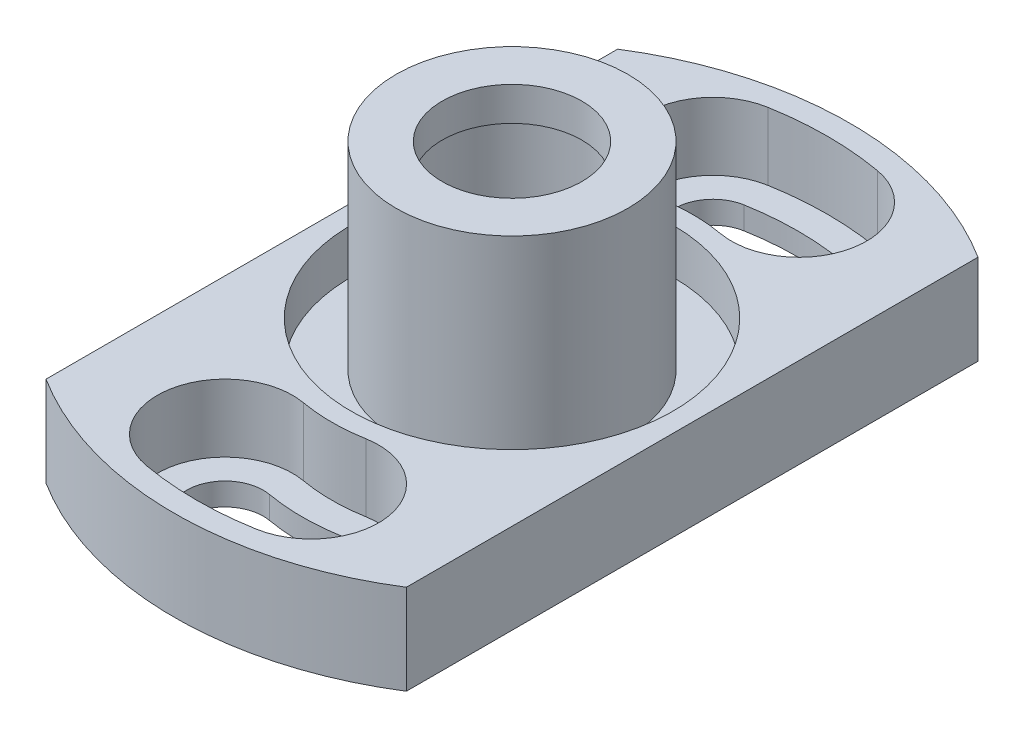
ISO-10303-21;
HEADER;
FILE_DESCRIPTION(('STEP AP214'),'2;1');
FILE_NAME('part.step','',(''),(''),'','','');
FILE_SCHEMA(('AUTOMOTIVE_DESIGN { 1 0 10303 214 1 1 1 1 }'));
ENDSEC;
DATA;
#1=APPLICATION_CONTEXT('core data for automotive mechanical design processes');
#2=APPLICATION_PROTOCOL_DEFINITION('international standard','automotive_design',2000,#1);
#3=PRODUCT_CONTEXT('',#1,'mechanical');
#4=PRODUCT('Part','Part','',(#3));
#5=PRODUCT_RELATED_PRODUCT_CATEGORY('part','',(#4));
#6=PRODUCT_DEFINITION_FORMATION('','',#4);
#7=PRODUCT_DEFINITION_CONTEXT('part definition',#1,'design');
#8=PRODUCT_DEFINITION('design','',#6,#7);
#9=PRODUCT_DEFINITION_SHAPE('','',#8);
#10=(LENGTH_UNIT() NAMED_UNIT(*) SI_UNIT(.MILLI.,.METRE.));
#11=(NAMED_UNIT(*) PLANE_ANGLE_UNIT() SI_UNIT($,.RADIAN.));
#12=(NAMED_UNIT(*) SI_UNIT($,.STERADIAN.) SOLID_ANGLE_UNIT());
#13=UNCERTAINTY_MEASURE_WITH_UNIT(LENGTH_MEASURE(1.E-05),#10,'distance_accuracy_value','');
#14=(GEOMETRIC_REPRESENTATION_CONTEXT(3) GLOBAL_UNCERTAINTY_ASSIGNED_CONTEXT((#13)) GLOBAL_UNIT_ASSIGNED_CONTEXT((#10,
#11,#12)) REPRESENTATION_CONTEXT('',''));
#15=CARTESIAN_POINT('',(0.,0.,0.));
#16=DIRECTION('',(0.,0.,1.));
#17=DIRECTION('',(1.,0.,0.));
#18=AXIS2_PLACEMENT_3D('',#15,#16,#17);
#19=CARTESIAN_POINT('',(15.,4.,0.));
#20=DIRECTION('',(0.,1.,0.));
#21=DIRECTION('',(0.,0.,1.));
#22=AXIS2_PLACEMENT_3D('',#19,#20,#21);
#23=PLANE('',#22);
#24=CARTESIAN_POINT('',(-1.91012995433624,4.,-10.8328852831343));
#25=DIRECTION('',(0.,1.,0.));
#26=DIRECTION('',(0.,0.,-1.));
#27=AXIS2_PLACEMENT_3D('',#24,#25,#26);
#28=CIRCLE('',#27,3.);
#29=CARTESIAN_POINT('',(-2.43107448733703,4.,-13.7873085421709));
#30=VERTEX_POINT('',#29);
#31=CARTESIAN_POINT('',(-1.38918542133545,4.,-7.87846202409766));
#32=VERTEX_POINT('',#31);
#33=EDGE_CURVE('E39',#30,#32,#28,.T.);
#34=ORIENTED_EDGE('',*,*,#33,.F.);
#35=CARTESIAN_POINT('',(0.,4.,0.));
#36=DIRECTION('',(0.,1.,0.));
#37=DIRECTION('',(0.,0.,-1.));
#38=AXIS2_PLACEMENT_3D('',#35,#36,#37);
#39=CIRCLE('',#38,14.);
#40=CARTESIAN_POINT('',(2.43107448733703,4.,-13.7873085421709));
#41=VERTEX_POINT('',#40);
#42=EDGE_CURVE('E202',#41,#30,#39,.T.);
#43=ORIENTED_EDGE('',*,*,#42,.F.);
#44=CARTESIAN_POINT('',(1.91012995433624,4.,-10.8328852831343));
#45=DIRECTION('',(0.,1.,0.));
#46=DIRECTION('',(0.,0.,-1.));
#47=AXIS2_PLACEMENT_3D('',#44,#45,#46);
#48=CIRCLE('',#47,3.);
#49=CARTESIAN_POINT('',(1.38918542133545,4.,-7.87846202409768));
#50=VERTEX_POINT('',#49);
#51=EDGE_CURVE('E205',#50,#41,#48,.T.);
#52=ORIENTED_EDGE('',*,*,#51,.F.);
#53=CARTESIAN_POINT('',(0.,4.,0.));
#54=DIRECTION('',(0.,-1.,0.));
#55=DIRECTION('',(0.,0.,-1.));
#56=AXIS2_PLACEMENT_3D('',#53,#54,#55);
#57=CIRCLE('',#56,8.);
#58=EDGE_CURVE('E209',#32,#50,#57,.T.);
#59=ORIENTED_EDGE('',*,*,#58,.F.);
#60=EDGE_LOOP('',(#34,#43,#52,#59));
#61=FACE_BOUND('',#60,.T.);
#62=CARTESIAN_POINT('',(0.,4.,0.));
#63=DIRECTION('',(0.,-1.,0.));
#64=DIRECTION('',(0.,0.,-1.));
#65=AXIS2_PLACEMENT_3D('',#62,#63,#64);
#66=CIRCLE('',#65,7.15);
#67=CARTESIAN_POINT('',(0.,4.,-7.15));
#68=VERTEX_POINT('',#67);
#69=EDGE_CURVE('E310',#68,#68,#66,.T.);
#70=ORIENTED_EDGE('',*,*,#69,.T.);
#71=EDGE_LOOP('',(#70));
#72=FACE_BOUND('',#71,.T.);
#73=CARTESIAN_POINT('',(0.,4.,0.));
#74=DIRECTION('',(0.,-1.,0.));
#75=DIRECTION('',(0.,0.,-1.));
#76=AXIS2_PLACEMENT_3D('',#73,#74,#75);
#77=CIRCLE('',#76,15.);
#78=CARTESIAN_POINT('',(8.,4.,12.6885775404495));
#79=VERTEX_POINT('',#78);
#80=CARTESIAN_POINT('',(-8.,4.,12.6885775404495));
#81=VERTEX_POINT('',#80);
#82=EDGE_CURVE('E316',#79,#81,#77,.T.);
#83=ORIENTED_EDGE('',*,*,#82,.F.);
#84=DIRECTION('',(0.,0.,-1.));
#85=VECTOR('',#84,1.);
#86=CARTESIAN_POINT('',(8.,4.,0.));
#87=LINE('',#86,#85);
#88=CARTESIAN_POINT('',(8.,4.,-12.6885775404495));
#89=VERTEX_POINT('',#88);
#90=EDGE_CURVE('E336',#79,#89,#87,.T.);
#91=ORIENTED_EDGE('',*,*,#90,.T.);
#92=CARTESIAN_POINT('',(-8.,4.,-12.6885775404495));
#93=VERTEX_POINT('',#92);
#94=EDGE_CURVE('E313',#93,#89,#77,.T.);
#95=ORIENTED_EDGE('',*,*,#94,.F.);
#96=DIRECTION('',(0.,0.,1.));
#97=VECTOR('',#96,1.);
#98=CARTESIAN_POINT('',(-8.,4.,0.));
#99=LINE('',#98,#97);
#100=EDGE_CURVE('E333',#93,#81,#99,.T.);
#101=ORIENTED_EDGE('',*,*,#100,.T.);
#102=EDGE_LOOP('',(#83,#91,#95,#101));
#103=FACE_BOUND('',#102,.T.);
#104=CARTESIAN_POINT('',(-1.91012995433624,4.,10.8328852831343));
#105=DIRECTION('',(0.,1.,0.));
#106=DIRECTION('',(0.,0.,1.));
#107=AXIS2_PLACEMENT_3D('',#104,#105,#106);
#108=CIRCLE('',#107,3.);
#109=CARTESIAN_POINT('',(-1.38918542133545,4.,7.87846202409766));
#110=VERTEX_POINT('',#109);
#111=CARTESIAN_POINT('',(-2.43107448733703,4.,13.7873085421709));
#112=VERTEX_POINT('',#111);
#113=EDGE_CURVE('E31',#110,#112,#108,.T.);
#114=ORIENTED_EDGE('',*,*,#113,.F.);
#115=CARTESIAN_POINT('',(0.,4.,0.));
#116=DIRECTION('',(0.,-1.,0.));
#117=DIRECTION('',(0.,0.,1.));
#118=AXIS2_PLACEMENT_3D('',#115,#116,#117);
#119=CIRCLE('',#118,8.);
#120=CARTESIAN_POINT('',(1.38918542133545,4.,7.87846202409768));
#121=VERTEX_POINT('',#120);
#122=EDGE_CURVE('E174',#121,#110,#119,.T.);
#123=ORIENTED_EDGE('',*,*,#122,.F.);
#124=CARTESIAN_POINT('',(1.91012995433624,4.,10.8328852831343));
#125=DIRECTION('',(0.,1.,0.));
#126=DIRECTION('',(0.,0.,1.));
#127=AXIS2_PLACEMENT_3D('',#124,#125,#126);
#128=CIRCLE('',#127,3.);
#129=CARTESIAN_POINT('',(2.43107448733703,4.,13.7873085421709));
#130=VERTEX_POINT('',#129);
#131=EDGE_CURVE('E177',#130,#121,#128,.T.);
#132=ORIENTED_EDGE('',*,*,#131,.F.);
#133=CARTESIAN_POINT('',(0.,4.,0.));
#134=DIRECTION('',(0.,1.,0.));
#135=DIRECTION('',(0.,0.,1.));
#136=AXIS2_PLACEMENT_3D('',#133,#134,#135);
#137=CIRCLE('',#136,14.);
#138=EDGE_CURVE('E183',#112,#130,#137,.T.);
#139=ORIENTED_EDGE('',*,*,#138,.F.);
#140=EDGE_LOOP('',(#114,#123,#132,#139));
#141=FACE_BOUND('',#140,.T.);
#142=ADVANCED_FACE('F16',(#61,#72,#103,#141),#23,.T.);
#143=CARTESIAN_POINT('',(-1.91012995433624,0.,10.8328852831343));
#144=DIRECTION('',(0.,1.,0.));
#145=DIRECTION('',(0.,0.,1.));
#146=AXIS2_PLACEMENT_3D('',#143,#144,#145);
#147=CYLINDRICAL_SURFACE('',#146,1.7);
#148=CARTESIAN_POINT('',(-1.91012995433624,1.,10.8328852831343));
#149=DIRECTION('',(0.,1.,0.));
#150=DIRECTION('',(0.,0.,1.));
#151=AXIS2_PLACEMENT_3D('',#148,#149,#150);
#152=CIRCLE('',#151,1.7);
#153=CARTESIAN_POINT('',(-2.20533185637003,1.,12.507058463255));
#154=VERTEX_POINT('',#153);
#155=CARTESIAN_POINT('',(-1.61492805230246,1.,9.15871210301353));
#156=VERTEX_POINT('',#155);
#157=EDGE_CURVE('E226',#154,#156,#152,.F.);
#158=ORIENTED_EDGE('',*,*,#157,.F.);
#159=DIRECTION('',(0.,1.,0.));
#160=VECTOR('',#159,1.);
#161=CARTESIAN_POINT('',(-2.20533185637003,0.,12.507058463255));
#162=LINE('',#161,#160);
#163=CARTESIAN_POINT('',(-2.20533185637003,0.,12.507058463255));
#164=VERTEX_POINT('',#163);
#165=EDGE_CURVE('E251',#164,#154,#162,.T.);
#166=ORIENTED_EDGE('',*,*,#165,.F.);
#167=CARTESIAN_POINT('',(-1.91012995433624,0.,10.8328852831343));
#168=DIRECTION('',(0.,1.,0.));
#169=DIRECTION('',(0.,0.,1.));
#170=AXIS2_PLACEMENT_3D('',#167,#168,#169);
#171=CIRCLE('',#170,1.7);
#172=CARTESIAN_POINT('',(-1.61492805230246,0.,9.15871210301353));
#173=VERTEX_POINT('',#172);
#174=EDGE_CURVE('E238',#173,#164,#171,.T.);
#175=ORIENTED_EDGE('',*,*,#174,.F.);
#176=DIRECTION('',(0.,1.,0.));
#177=VECTOR('',#176,1.);
#178=CARTESIAN_POINT('',(-1.61492805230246,0.,9.15871210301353));
#179=LINE('',#178,#177);
#180=EDGE_CURVE('E252',#173,#156,#179,.T.);
#181=ORIENTED_EDGE('',*,*,#180,.T.);
#182=EDGE_LOOP('',(#158,#166,#175,#181));
#183=FACE_BOUND('',#182,.T.);
#184=ADVANCED_FACE('F345',(#183),#147,.F.);
#185=CARTESIAN_POINT('',(0.,0.,0.));
#186=DIRECTION('',(0.,1.,0.));
#187=DIRECTION('',(0.,0.,1.));
#188=AXIS2_PLACEMENT_3D('',#185,#186,#187);
#189=CYLINDRICAL_SURFACE('',#188,9.3);
#190=CARTESIAN_POINT('',(0.,1.,0.));
#191=DIRECTION('',(0.,1.,0.));
#192=DIRECTION('',(0.,0.,1.));
#193=AXIS2_PLACEMENT_3D('',#190,#191,#192);
#194=CIRCLE('',#193,9.3);
#195=CARTESIAN_POINT('',(1.61492805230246,1.,9.15871210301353));
#196=VERTEX_POINT('',#195);
#197=EDGE_CURVE('E224',#156,#196,#194,.T.);
#198=ORIENTED_EDGE('',*,*,#197,.F.);
#199=ORIENTED_EDGE('',*,*,#180,.F.);
#200=CARTESIAN_POINT('',(0.,0.,0.));
#201=DIRECTION('',(0.,-1.,0.));
#202=DIRECTION('',(0.,0.,1.));
#203=AXIS2_PLACEMENT_3D('',#200,#201,#202);
#204=CIRCLE('',#203,9.3);
#205=CARTESIAN_POINT('',(1.61492805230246,0.,9.15871210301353));
#206=VERTEX_POINT('',#205);
#207=EDGE_CURVE('E248',#206,#173,#204,.T.);
#208=ORIENTED_EDGE('',*,*,#207,.F.);
#209=DIRECTION('',(0.,1.,0.));
#210=VECTOR('',#209,1.);
#211=CARTESIAN_POINT('',(1.61492805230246,0.,9.15871210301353));
#212=LINE('',#211,#210);
#213=EDGE_CURVE('E256',#206,#196,#212,.T.);
#214=ORIENTED_EDGE('',*,*,#213,.T.);
#215=EDGE_LOOP('',(#198,#199,#208,#214));
#216=FACE_BOUND('',#215,.T.);
#217=ADVANCED_FACE('F353',(#216),#189,.T.);
#218=CARTESIAN_POINT('',(1.91012995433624,0.,10.8328852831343));
#219=DIRECTION('',(0.,1.,0.));
#220=DIRECTION('',(0.,0.,1.));
#221=AXIS2_PLACEMENT_3D('',#218,#219,#220);
#222=CYLINDRICAL_SURFACE('',#221,1.7);
#223=CARTESIAN_POINT('',(1.91012995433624,1.,10.8328852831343));
#224=DIRECTION('',(0.,1.,0.));
#225=DIRECTION('',(0.,0.,1.));
#226=AXIS2_PLACEMENT_3D('',#223,#224,#225);
#227=CIRCLE('',#226,1.7);
#228=CARTESIAN_POINT('',(2.20533185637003,1.,12.507058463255));
#229=VERTEX_POINT('',#228);
#230=EDGE_CURVE('E189',#196,#229,#227,.F.);
#231=ORIENTED_EDGE('',*,*,#230,.F.);
#232=ORIENTED_EDGE('',*,*,#213,.F.);
#233=CARTESIAN_POINT('',(1.91012995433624,0.,10.8328852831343));
#234=DIRECTION('',(0.,1.,0.));
#235=DIRECTION('',(0.,0.,1.));
#236=AXIS2_PLACEMENT_3D('',#233,#234,#235);
#237=CIRCLE('',#236,1.7);
#238=CARTESIAN_POINT('',(2.20533185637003,0.,12.507058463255));
#239=VERTEX_POINT('',#238);
#240=EDGE_CURVE('E245',#239,#206,#237,.T.);
#241=ORIENTED_EDGE('',*,*,#240,.F.);
#242=DIRECTION('',(0.,1.,0.));
#243=VECTOR('',#242,1.);
#244=CARTESIAN_POINT('',(2.20533185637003,0.,12.507058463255));
#245=LINE('',#244,#243);
#246=EDGE_CURVE('E259',#239,#229,#245,.T.);
#247=ORIENTED_EDGE('',*,*,#246,.T.);
#248=EDGE_LOOP('',(#231,#232,#241,#247));
#249=FACE_BOUND('',#248,.T.);
#250=ADVANCED_FACE('F355',(#249),#222,.F.);
#251=CARTESIAN_POINT('',(0.,0.,0.));
#252=DIRECTION('',(0.,1.,0.));
#253=DIRECTION('',(0.,0.,1.));
#254=AXIS2_PLACEMENT_3D('',#251,#252,#253);
#255=CYLINDRICAL_SURFACE('',#254,12.7);
#256=CARTESIAN_POINT('',(0.,1.,0.));
#257=DIRECTION('',(0.,1.,0.));
#258=DIRECTION('',(0.,0.,1.));
#259=AXIS2_PLACEMENT_3D('',#256,#257,#258);
#260=CIRCLE('',#259,12.7);
#261=EDGE_CURVE('E24',#229,#154,#260,.F.);
#262=ORIENTED_EDGE('',*,*,#261,.F.);
#263=ORIENTED_EDGE('',*,*,#246,.F.);
#264=CARTESIAN_POINT('',(0.,0.,0.));
#265=DIRECTION('',(0.,1.,0.));
#266=DIRECTION('',(0.,0.,1.));
#267=AXIS2_PLACEMENT_3D('',#264,#265,#266);
#268=CIRCLE('',#267,12.7);
#269=EDGE_CURVE('E241',#164,#239,#268,.T.);
#270=ORIENTED_EDGE('',*,*,#269,.F.);
#271=ORIENTED_EDGE('',*,*,#165,.T.);
#272=EDGE_LOOP('',(#262,#263,#270,#271));
#273=FACE_BOUND('',#272,.T.);
#274=ADVANCED_FACE('F348',(#273),#255,.F.);
#275=CARTESIAN_POINT('',(3.6,0.,0.));
#276=DIRECTION('',(0.,-1.,0.));
#277=DIRECTION('',(0.,0.,-1.));
#278=AXIS2_PLACEMENT_3D('',#275,#276,#277);
#279=PLANE('',#278);
#280=CARTESIAN_POINT('',(-1.91012995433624,0.,-10.8328852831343));
#281=DIRECTION('',(0.,1.,0.));
#282=DIRECTION('',(0.,0.,-1.));
#283=AXIS2_PLACEMENT_3D('',#280,#281,#282);
#284=CIRCLE('',#283,1.7);
#285=CARTESIAN_POINT('',(-2.20533185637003,0.,-12.507058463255));
#286=VERTEX_POINT('',#285);
#287=CARTESIAN_POINT('',(-1.61492805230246,0.,-9.15871210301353));
#288=VERTEX_POINT('',#287);
#289=EDGE_CURVE('E242',#286,#288,#284,.T.);
#290=ORIENTED_EDGE('',*,*,#289,.T.);
#291=CARTESIAN_POINT('',(0.,0.,0.));
#292=DIRECTION('',(0.,-1.,0.));
#293=DIRECTION('',(0.,0.,-1.));
#294=AXIS2_PLACEMENT_3D('',#291,#292,#293);
#295=CIRCLE('',#294,9.3);
#296=CARTESIAN_POINT('',(1.61492805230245,0.,-9.15871210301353));
#297=VERTEX_POINT('',#296);
#298=EDGE_CURVE('E281',#288,#297,#295,.T.);
#299=ORIENTED_EDGE('',*,*,#298,.T.);
#300=CARTESIAN_POINT('',(1.91012995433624,0.,-10.8328852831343));
#301=DIRECTION('',(0.,1.,0.));
#302=DIRECTION('',(0.,0.,-1.));
#303=AXIS2_PLACEMENT_3D('',#300,#301,#302);
#304=CIRCLE('',#303,1.7);
#305=CARTESIAN_POINT('',(2.20533185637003,0.,-12.507058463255));
#306=VERTEX_POINT('',#305);
#307=EDGE_CURVE('E278',#297,#306,#304,.T.);
#308=ORIENTED_EDGE('',*,*,#307,.T.);
#309=CARTESIAN_POINT('',(0.,0.,0.));
#310=DIRECTION('',(0.,1.,0.));
#311=DIRECTION('',(0.,0.,-1.));
#312=AXIS2_PLACEMENT_3D('',#309,#310,#311);
#313=CIRCLE('',#312,12.7);
#314=EDGE_CURVE('E267',#306,#286,#313,.T.);
#315=ORIENTED_EDGE('',*,*,#314,.T.);
#316=EDGE_LOOP('',(#290,#299,#308,#315));
#317=FACE_BOUND('',#316,.T.);
#318=CARTESIAN_POINT('',(0.,0.,0.));
#319=DIRECTION('',(0.,-1.,0.));
#320=DIRECTION('',(0.,0.,-1.));
#321=AXIS2_PLACEMENT_3D('',#318,#319,#320);
#322=CIRCLE('',#321,3.6);
#323=CARTESIAN_POINT('',(0.,0.,-3.6));
#324=VERTEX_POINT('',#323);
#325=EDGE_CURVE('E321',#324,#324,#322,.T.);
#326=ORIENTED_EDGE('',*,*,#325,.F.);
#327=EDGE_LOOP('',(#326));
#328=FACE_BOUND('',#327,.T.);
#329=CARTESIAN_POINT('',(0.,0.,0.));
#330=DIRECTION('',(0.,-1.,0.));
#331=DIRECTION('',(0.,0.,-1.));
#332=AXIS2_PLACEMENT_3D('',#329,#330,#331);
#333=CIRCLE('',#332,15.);
#334=CARTESIAN_POINT('',(-8.,0.,-12.6885775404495));
#335=VERTEX_POINT('',#334);
#336=CARTESIAN_POINT('',(8.,0.,-12.6885775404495));
#337=VERTEX_POINT('',#336);
#338=EDGE_CURVE('E317',#335,#337,#333,.T.);
#339=ORIENTED_EDGE('',*,*,#338,.T.);
#340=DIRECTION('',(0.,0.,-1.));
#341=VECTOR('',#340,1.);
#342=CARTESIAN_POINT('',(8.,0.,-17.8859181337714));
#343=LINE('',#342,#341);
#344=CARTESIAN_POINT('',(8.,0.,12.6885775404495));
#345=VERTEX_POINT('',#344);
#346=EDGE_CURVE('E255',#345,#337,#343,.T.);
#347=ORIENTED_EDGE('',*,*,#346,.F.);
#348=CARTESIAN_POINT('',(-8.,0.,12.6885775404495));
#349=VERTEX_POINT('',#348);
#350=EDGE_CURVE('E320',#345,#349,#333,.T.);
#351=ORIENTED_EDGE('',*,*,#350,.T.);
#352=DIRECTION('',(0.,0.,1.));
#353=VECTOR('',#352,1.);
#354=CARTESIAN_POINT('',(-8.,0.,-17.8859181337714));
#355=LINE('',#354,#353);
#356=EDGE_CURVE('E287',#335,#349,#355,.T.);
#357=ORIENTED_EDGE('',*,*,#356,.F.);
#358=EDGE_LOOP('',(#339,#347,#351,#357));
#359=FACE_BOUND('',#358,.T.);
#360=ORIENTED_EDGE('',*,*,#174,.T.);
#361=ORIENTED_EDGE('',*,*,#269,.T.);
#362=ORIENTED_EDGE('',*,*,#240,.T.);
#363=ORIENTED_EDGE('',*,*,#207,.T.);
#364=EDGE_LOOP('',(#360,#361,#362,#363));
#365=FACE_BOUND('',#364,.T.);
#366=ADVANCED_FACE('F350',(#317,#328,#359,#365),#279,.T.);
#367=CARTESIAN_POINT('',(0.,0.,0.));
#368=DIRECTION('',(0.,-1.,0.));
#369=DIRECTION('',(0.,0.,-1.));
#370=AXIS2_PLACEMENT_3D('',#367,#368,#369);
#371=CYLINDRICAL_SURFACE('',#370,15.);
#372=ORIENTED_EDGE('',*,*,#350,.F.);
#373=DIRECTION('',(0.,-1.,0.));
#374=VECTOR('',#373,1.);
#375=CARTESIAN_POINT('',(8.,0.,12.6885775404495));
#376=LINE('',#375,#374);
#377=EDGE_CURVE('E298',#345,#79,#376,.F.);
#378=ORIENTED_EDGE('',*,*,#377,.T.);
#379=ORIENTED_EDGE('',*,*,#82,.T.);
#380=DIRECTION('',(0.,-1.,0.));
#381=VECTOR('',#380,1.);
#382=CARTESIAN_POINT('',(-8.,0.,12.6885775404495));
#383=LINE('',#382,#381);
#384=EDGE_CURVE('E289',#81,#349,#383,.T.);
#385=ORIENTED_EDGE('',*,*,#384,.T.);
#386=EDGE_LOOP('',(#372,#378,#379,#385));
#387=FACE_BOUND('',#386,.T.);
#388=ADVANCED_FACE('F379',(#387),#371,.T.);
#389=ORIENTED_EDGE('',*,*,#94,.T.);
#390=DIRECTION('',(0.,-1.,0.));
#391=VECTOR('',#390,1.);
#392=CARTESIAN_POINT('',(8.,0.,-12.6885775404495));
#393=LINE('',#392,#391);
#394=EDGE_CURVE('E295',#89,#337,#393,.T.);
#395=ORIENTED_EDGE('',*,*,#394,.T.);
#396=ORIENTED_EDGE('',*,*,#338,.F.);
#397=DIRECTION('',(0.,-1.,0.));
#398=VECTOR('',#397,1.);
#399=CARTESIAN_POINT('',(-8.,0.,-12.6885775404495));
#400=LINE('',#399,#398);
#401=EDGE_CURVE('E292',#335,#93,#400,.F.);
#402=ORIENTED_EDGE('',*,*,#401,.T.);
#403=EDGE_LOOP('',(#389,#395,#396,#402));
#404=FACE_BOUND('',#403,.T.);
#405=ADVANCED_FACE('F382',(#404),#371,.T.);
#406=CARTESIAN_POINT('',(5.15,10.8,0.));
#407=DIRECTION('',(0.,1.,0.));
#408=DIRECTION('',(0.,0.,1.));
#409=AXIS2_PLACEMENT_3D('',#406,#407,#408);
#410=PLANE('',#409);
#411=CARTESIAN_POINT('',(0.,10.8,0.));
#412=DIRECTION('',(0.,-1.,0.));
#413=DIRECTION('',(0.,0.,-1.));
#414=AXIS2_PLACEMENT_3D('',#411,#412,#413);
#415=CIRCLE('',#414,3.1);
#416=CARTESIAN_POINT('',(0.,10.8,-3.1));
#417=VERTEX_POINT('',#416);
#418=EDGE_CURVE('E330',#417,#417,#415,.T.);
#419=ORIENTED_EDGE('',*,*,#418,.T.);
#420=EDGE_LOOP('',(#419));
#421=FACE_BOUND('',#420,.T.);
#422=CARTESIAN_POINT('',(0.,10.8,0.));
#423=DIRECTION('',(0.,-1.,0.));
#424=DIRECTION('',(0.,0.,-1.));
#425=AXIS2_PLACEMENT_3D('',#422,#423,#424);
#426=CIRCLE('',#425,5.15);
#427=CARTESIAN_POINT('',(0.,10.8,-5.15));
#428=VERTEX_POINT('',#427);
#429=EDGE_CURVE('E301',#428,#428,#426,.T.);
#430=ORIENTED_EDGE('',*,*,#429,.F.);
#431=EDGE_LOOP('',(#430));
#432=FACE_BOUND('',#431,.T.);
#433=ADVANCED_FACE('F18',(#421,#432),#410,.T.);
#434=CARTESIAN_POINT('',(0.,0.,0.));
#435=DIRECTION('',(0.,-1.,0.));
#436=DIRECTION('',(0.,0.,-1.));
#437=AXIS2_PLACEMENT_3D('',#434,#435,#436);
#438=CYLINDRICAL_SURFACE('',#437,3.1);
#439=CARTESIAN_POINT('',(0.,9.3,0.));
#440=DIRECTION('',(0.,-1.,0.));
#441=DIRECTION('',(0.,0.,-1.));
#442=AXIS2_PLACEMENT_3D('',#439,#440,#441);
#443=CIRCLE('',#442,3.1);
#444=CARTESIAN_POINT('',(0.,9.3,-3.1));
#445=VERTEX_POINT('',#444);
#446=EDGE_CURVE('E327',#445,#445,#443,.T.);
#447=ORIENTED_EDGE('',*,*,#446,.T.);
#448=EDGE_LOOP('',(#447));
#449=FACE_BOUND('',#448,.T.);
#450=ORIENTED_EDGE('',*,*,#418,.F.);
#451=EDGE_LOOP('',(#450));
#452=FACE_BOUND('',#451,.T.);
#453=ADVANCED_FACE('F393',(#449,#452),#438,.F.);
#454=CARTESIAN_POINT('',(3.1,9.3,0.));
#455=DIRECTION('',(0.,-1.,0.));
#456=DIRECTION('',(0.,0.,-1.));
#457=AXIS2_PLACEMENT_3D('',#454,#455,#456);
#458=PLANE('',#457);
#459=CARTESIAN_POINT('',(0.,9.3,0.));
#460=DIRECTION('',(0.,-1.,0.));
#461=DIRECTION('',(0.,0.,-1.));
#462=AXIS2_PLACEMENT_3D('',#459,#460,#461);
#463=CIRCLE('',#462,3.6);
#464=CARTESIAN_POINT('',(0.,9.3,-3.6));
#465=VERTEX_POINT('',#464);
#466=EDGE_CURVE('E324',#465,#465,#463,.T.);
#467=ORIENTED_EDGE('',*,*,#466,.T.);
#468=EDGE_LOOP('',(#467));
#469=FACE_BOUND('',#468,.T.);
#470=ORIENTED_EDGE('',*,*,#446,.F.);
#471=EDGE_LOOP('',(#470));
#472=FACE_BOUND('',#471,.T.);
#473=ADVANCED_FACE('F390',(#469,#472),#458,.T.);
#474=CARTESIAN_POINT('',(0.,0.,0.));
#475=DIRECTION('',(0.,-1.,0.));
#476=DIRECTION('',(0.,0.,-1.));
#477=AXIS2_PLACEMENT_3D('',#474,#475,#476);
#478=CYLINDRICAL_SURFACE('',#477,3.6);
#479=ORIENTED_EDGE('',*,*,#325,.T.);
#480=EDGE_LOOP('',(#479));
#481=FACE_BOUND('',#480,.T.);
#482=ORIENTED_EDGE('',*,*,#466,.F.);
#483=EDGE_LOOP('',(#482));
#484=FACE_BOUND('',#483,.T.);
#485=ADVANCED_FACE('F387',(#481,#484),#478,.F.);
#486=CARTESIAN_POINT('',(0.,0.,0.));
#487=DIRECTION('',(0.,-1.,0.));
#488=DIRECTION('',(0.,0.,-1.));
#489=AXIS2_PLACEMENT_3D('',#486,#487,#488);
#490=CYLINDRICAL_SURFACE('',#489,7.15);
#491=CARTESIAN_POINT('',(0.,2.,0.));
#492=DIRECTION('',(0.,-1.,0.));
#493=DIRECTION('',(0.,0.,-1.));
#494=AXIS2_PLACEMENT_3D('',#491,#492,#493);
#495=CIRCLE('',#494,7.15);
#496=CARTESIAN_POINT('',(0.,2.,-7.15));
#497=VERTEX_POINT('',#496);
#498=EDGE_CURVE('E307',#497,#497,#495,.T.);
#499=ORIENTED_EDGE('',*,*,#498,.T.);
#500=EDGE_LOOP('',(#499));
#501=FACE_BOUND('',#500,.T.);
#502=ORIENTED_EDGE('',*,*,#69,.F.);
#503=EDGE_LOOP('',(#502));
#504=FACE_BOUND('',#503,.T.);
#505=ADVANCED_FACE('F377',(#501,#504),#490,.F.);
#506=CARTESIAN_POINT('',(7.15,2.,0.));
#507=DIRECTION('',(0.,1.,0.));
#508=DIRECTION('',(0.,0.,1.));
#509=AXIS2_PLACEMENT_3D('',#506,#507,#508);
#510=PLANE('',#509);
#511=CARTESIAN_POINT('',(0.,2.,0.));
#512=DIRECTION('',(0.,-1.,0.));
#513=DIRECTION('',(0.,0.,-1.));
#514=AXIS2_PLACEMENT_3D('',#511,#512,#513);
#515=CIRCLE('',#514,5.15);
#516=CARTESIAN_POINT('',(0.,2.,-5.15));
#517=VERTEX_POINT('',#516);
#518=EDGE_CURVE('E304',#517,#517,#515,.T.);
#519=ORIENTED_EDGE('',*,*,#518,.T.);
#520=EDGE_LOOP('',(#519));
#521=FACE_BOUND('',#520,.T.);
#522=ORIENTED_EDGE('',*,*,#498,.F.);
#523=EDGE_LOOP('',(#522));
#524=FACE_BOUND('',#523,.T.);
#525=ADVANCED_FACE('F412',(#521,#524),#510,.T.);
#526=CARTESIAN_POINT('',(0.,0.,0.));
#527=DIRECTION('',(0.,-1.,0.));
#528=DIRECTION('',(0.,0.,-1.));
#529=AXIS2_PLACEMENT_3D('',#526,#527,#528);
#530=CYLINDRICAL_SURFACE('',#529,5.15);
#531=ORIENTED_EDGE('',*,*,#429,.T.);
#532=EDGE_LOOP('',(#531));
#533=FACE_BOUND('',#532,.T.);
#534=ORIENTED_EDGE('',*,*,#518,.F.);
#535=EDGE_LOOP('',(#534));
#536=FACE_BOUND('',#535,.T.);
#537=ADVANCED_FACE('F408',(#533,#536),#530,.T.);
#538=CARTESIAN_POINT('',(-8.,0.,-17.8859181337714));
#539=DIRECTION('',(-1.,0.,0.));
#540=DIRECTION('',(0.,0.,1.));
#541=AXIS2_PLACEMENT_3D('',#538,#539,#540);
#542=PLANE('',#541);
#543=ORIENTED_EDGE('',*,*,#356,.T.);
#544=ORIENTED_EDGE('',*,*,#384,.F.);
#545=ORIENTED_EDGE('',*,*,#100,.F.);
#546=ORIENTED_EDGE('',*,*,#401,.F.);
#547=EDGE_LOOP('',(#543,#544,#545,#546));
#548=FACE_BOUND('',#547,.T.);
#549=ADVANCED_FACE('F411',(#548),#542,.T.);
#550=CARTESIAN_POINT('',(8.,0.,-17.8859181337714));
#551=DIRECTION('',(1.,0.,0.));
#552=DIRECTION('',(0.,0.,-1.));
#553=AXIS2_PLACEMENT_3D('',#550,#551,#552);
#554=PLANE('',#553);
#555=ORIENTED_EDGE('',*,*,#346,.T.);
#556=ORIENTED_EDGE('',*,*,#394,.F.);
#557=ORIENTED_EDGE('',*,*,#90,.F.);
#558=ORIENTED_EDGE('',*,*,#377,.F.);
#559=EDGE_LOOP('',(#555,#556,#557,#558));
#560=FACE_BOUND('',#559,.T.);
#561=ADVANCED_FACE('F483',(#560),#554,.T.);
#562=CARTESIAN_POINT('',(-1.91012995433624,0.,-10.8328852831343));
#563=DIRECTION('',(0.,1.,0.));
#564=DIRECTION('',(0.,0.,1.));
#565=AXIS2_PLACEMENT_3D('',#562,#563,#564);
#566=CYLINDRICAL_SURFACE('',#565,1.7);
#567=DIRECTION('',(0.,1.,0.));
#568=VECTOR('',#567,1.);
#569=CARTESIAN_POINT('',(-2.20533185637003,0.,-12.507058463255));
#570=LINE('',#569,#568);
#571=CARTESIAN_POINT('',(-2.20533185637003,1.,-12.507058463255));
#572=VERTEX_POINT('',#571);
#573=EDGE_CURVE('E237',#286,#572,#570,.T.);
#574=ORIENTED_EDGE('',*,*,#573,.T.);
#575=CARTESIAN_POINT('',(-1.91012995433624,1.,-10.8328852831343));
#576=DIRECTION('',(0.,-1.,0.));
#577=DIRECTION('',(0.,0.,-1.));
#578=AXIS2_PLACEMENT_3D('',#575,#576,#577);
#579=CIRCLE('',#578,1.7);
#580=CARTESIAN_POINT('',(-1.61492805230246,1.,-9.15871210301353));
#581=VERTEX_POINT('',#580);
#582=EDGE_CURVE('E234',#572,#581,#579,.F.);
#583=ORIENTED_EDGE('',*,*,#582,.T.);
#584=DIRECTION('',(0.,1.,0.));
#585=VECTOR('',#584,1.);
#586=CARTESIAN_POINT('',(-1.61492805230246,0.,-9.15871210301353));
#587=LINE('',#586,#585);
#588=EDGE_CURVE('E264',#288,#581,#587,.T.);
#589=ORIENTED_EDGE('',*,*,#588,.F.);
#590=ORIENTED_EDGE('',*,*,#289,.F.);
#591=EDGE_LOOP('',(#574,#583,#589,#590));
#592=FACE_BOUND('',#591,.T.);
#593=ADVANCED_FACE('F481',(#592),#566,.F.);
#594=CARTESIAN_POINT('',(0.,0.,0.));
#595=DIRECTION('',(0.,1.,0.));
#596=DIRECTION('',(0.,0.,1.));
#597=AXIS2_PLACEMENT_3D('',#594,#595,#596);
#598=CYLINDRICAL_SURFACE('',#597,12.7);
#599=DIRECTION('',(0.,1.,0.));
#600=VECTOR('',#599,1.);
#601=CARTESIAN_POINT('',(2.20533185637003,0.,-12.507058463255));
#602=LINE('',#601,#600);
#603=CARTESIAN_POINT('',(2.20533185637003,1.,-12.507058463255));
#604=VERTEX_POINT('',#603);
#605=EDGE_CURVE('E271',#306,#604,#602,.T.);
#606=ORIENTED_EDGE('',*,*,#605,.T.);
#607=CARTESIAN_POINT('',(0.,1.,0.));
#608=DIRECTION('',(0.,-1.,0.));
#609=DIRECTION('',(0.,0.,-1.));
#610=AXIS2_PLACEMENT_3D('',#607,#608,#609);
#611=CIRCLE('',#610,12.7);
#612=EDGE_CURVE('E231',#604,#572,#611,.F.);
#613=ORIENTED_EDGE('',*,*,#612,.T.);
#614=ORIENTED_EDGE('',*,*,#573,.F.);
#615=ORIENTED_EDGE('',*,*,#314,.F.);
#616=EDGE_LOOP('',(#606,#613,#614,#615));
#617=FACE_BOUND('',#616,.T.);
#618=ADVANCED_FACE('F474',(#617),#598,.F.);
#619=CARTESIAN_POINT('',(1.91012995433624,0.,-10.8328852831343));
#620=DIRECTION('',(0.,1.,0.));
#621=DIRECTION('',(0.,0.,1.));
#622=AXIS2_PLACEMENT_3D('',#619,#620,#621);
#623=CYLINDRICAL_SURFACE('',#622,1.7);
#624=DIRECTION('',(0.,1.,0.));
#625=VECTOR('',#624,1.);
#626=CARTESIAN_POINT('',(1.61492805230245,0.,-9.15871210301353));
#627=LINE('',#626,#625);
#628=CARTESIAN_POINT('',(1.61492805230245,1.,-9.15871210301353));
#629=VERTEX_POINT('',#628);
#630=EDGE_CURVE('E268',#297,#629,#627,.T.);
#631=ORIENTED_EDGE('',*,*,#630,.T.);
#632=CARTESIAN_POINT('',(1.91012995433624,1.,-10.8328852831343));
#633=DIRECTION('',(0.,-1.,0.));
#634=DIRECTION('',(0.,0.,-1.));
#635=AXIS2_PLACEMENT_3D('',#632,#633,#634);
#636=CIRCLE('',#635,1.7);
#637=EDGE_CURVE('E228',#629,#604,#636,.F.);
#638=ORIENTED_EDGE('',*,*,#637,.T.);
#639=ORIENTED_EDGE('',*,*,#605,.F.);
#640=ORIENTED_EDGE('',*,*,#307,.F.);
#641=EDGE_LOOP('',(#631,#638,#639,#640));
#642=FACE_BOUND('',#641,.T.);
#643=ADVANCED_FACE('F471',(#642),#623,.F.);
#644=CARTESIAN_POINT('',(0.,0.,0.));
#645=DIRECTION('',(0.,1.,0.));
#646=DIRECTION('',(0.,0.,1.));
#647=AXIS2_PLACEMENT_3D('',#644,#645,#646);
#648=CYLINDRICAL_SURFACE('',#647,9.3);
#649=ORIENTED_EDGE('',*,*,#588,.T.);
#650=CARTESIAN_POINT('',(0.,1.,0.));
#651=DIRECTION('',(0.,-1.,0.));
#652=DIRECTION('',(0.,0.,-1.));
#653=AXIS2_PLACEMENT_3D('',#650,#651,#652);
#654=CIRCLE('',#653,9.3);
#655=EDGE_CURVE('E10',#581,#629,#654,.T.);
#656=ORIENTED_EDGE('',*,*,#655,.T.);
#657=ORIENTED_EDGE('',*,*,#630,.F.);
#658=ORIENTED_EDGE('',*,*,#298,.F.);
#659=EDGE_LOOP('',(#649,#656,#657,#658));
#660=FACE_BOUND('',#659,.T.);
#661=ADVANCED_FACE('F479',(#660),#648,.T.);
#662=CARTESIAN_POINT('',(-0.95506497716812,1.,5.41644264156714));
#663=DIRECTION('',(0.,1.,0.));
#664=DIRECTION('',(0.,0.,1.));
#665=AXIS2_PLACEMENT_3D('',#662,#663,#664);
#666=PLANE('',#665);
#667=CARTESIAN_POINT('',(-1.91012995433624,1.,10.8328852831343));
#668=DIRECTION('',(0.,1.,0.));
#669=DIRECTION('',(0.,0.,1.));
#670=AXIS2_PLACEMENT_3D('',#667,#668,#669);
#671=CIRCLE('',#670,3.);
#672=CARTESIAN_POINT('',(-1.38918542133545,1.,7.87846202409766));
#673=VERTEX_POINT('',#672);
#674=CARTESIAN_POINT('',(-2.43107448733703,1.,13.7873085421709));
#675=VERTEX_POINT('',#674);
#676=EDGE_CURVE('E155',#673,#675,#671,.T.);
#677=ORIENTED_EDGE('',*,*,#676,.T.);
#678=CARTESIAN_POINT('',(0.,1.,0.));
#679=DIRECTION('',(0.,1.,0.));
#680=DIRECTION('',(0.,0.,1.));
#681=AXIS2_PLACEMENT_3D('',#678,#679,#680);
#682=CIRCLE('',#681,14.);
#683=CARTESIAN_POINT('',(2.43107448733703,1.,13.7873085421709));
#684=VERTEX_POINT('',#683);
#685=EDGE_CURVE('E164',#675,#684,#682,.T.);
#686=ORIENTED_EDGE('',*,*,#685,.T.);
#687=CARTESIAN_POINT('',(1.91012995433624,1.,10.8328852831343));
#688=DIRECTION('',(0.,1.,0.));
#689=DIRECTION('',(0.,0.,1.));
#690=AXIS2_PLACEMENT_3D('',#687,#688,#689);
#691=CIRCLE('',#690,3.);
#692=CARTESIAN_POINT('',(1.38918542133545,1.,7.87846202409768));
#693=VERTEX_POINT('',#692);
#694=EDGE_CURVE('E169',#684,#693,#691,.T.);
#695=ORIENTED_EDGE('',*,*,#694,.T.);
#696=CARTESIAN_POINT('',(0.,1.,0.));
#697=DIRECTION('',(0.,-1.,0.));
#698=DIRECTION('',(0.,0.,1.));
#699=AXIS2_PLACEMENT_3D('',#696,#697,#698);
#700=CIRCLE('',#699,8.);
#701=EDGE_CURVE('E161',#693,#673,#700,.T.);
#702=ORIENTED_EDGE('',*,*,#701,.T.);
#703=EDGE_LOOP('',(#677,#686,#695,#702));
#704=FACE_BOUND('',#703,.T.);
#705=ORIENTED_EDGE('',*,*,#157,.T.);
#706=ORIENTED_EDGE('',*,*,#197,.T.);
#707=ORIENTED_EDGE('',*,*,#230,.T.);
#708=ORIENTED_EDGE('',*,*,#261,.T.);
#709=EDGE_LOOP('',(#705,#706,#707,#708));
#710=FACE_BOUND('',#709,.T.);
#711=ADVANCED_FACE('F171',(#704,#710),#666,.T.);
#712=CARTESIAN_POINT('',(-1.91012995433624,1.,10.8328852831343));
#713=DIRECTION('',(0.,1.,0.));
#714=DIRECTION('',(0.,0.,1.));
#715=AXIS2_PLACEMENT_3D('',#712,#713,#714);
#716=CYLINDRICAL_SURFACE('',#715,3.);
#717=ORIENTED_EDGE('',*,*,#113,.T.);
#718=DIRECTION('',(0.,1.,0.));
#719=VECTOR('',#718,1.);
#720=CARTESIAN_POINT('',(-2.43107448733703,1.,13.7873085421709));
#721=LINE('',#720,#719);
#722=EDGE_CURVE('E151',#675,#112,#721,.T.);
#723=ORIENTED_EDGE('',*,*,#722,.F.);
#724=ORIENTED_EDGE('',*,*,#676,.F.);
#725=DIRECTION('',(0.,1.,0.));
#726=VECTOR('',#725,1.);
#727=CARTESIAN_POINT('',(-1.38918542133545,1.,7.87846202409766));
#728=LINE('',#727,#726);
#729=EDGE_CURVE('E187',#673,#110,#728,.T.);
#730=ORIENTED_EDGE('',*,*,#729,.T.);
#731=EDGE_LOOP('',(#717,#723,#724,#730));
#732=FACE_BOUND('',#731,.T.);
#733=ADVANCED_FACE('F153',(#732),#716,.F.);
#734=CARTESIAN_POINT('',(0.,1.,0.));
#735=DIRECTION('',(0.,1.,0.));
#736=DIRECTION('',(0.,0.,1.));
#737=AXIS2_PLACEMENT_3D('',#734,#735,#736);
#738=CYLINDRICAL_SURFACE('',#737,8.);
#739=ORIENTED_EDGE('',*,*,#122,.T.);
#740=ORIENTED_EDGE('',*,*,#729,.F.);
#741=ORIENTED_EDGE('',*,*,#701,.F.);
#742=DIRECTION('',(0.,1.,0.));
#743=VECTOR('',#742,1.);
#744=CARTESIAN_POINT('',(1.38918542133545,1.,7.87846202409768));
#745=LINE('',#744,#743);
#746=EDGE_CURVE('E190',#693,#121,#745,.T.);
#747=ORIENTED_EDGE('',*,*,#746,.T.);
#748=EDGE_LOOP('',(#739,#740,#741,#747));
#749=FACE_BOUND('',#748,.T.);
#750=ADVANCED_FACE('F432',(#749),#738,.T.);
#751=CARTESIAN_POINT('',(1.91012995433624,1.,10.8328852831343));
#752=DIRECTION('',(0.,1.,0.));
#753=DIRECTION('',(0.,0.,1.));
#754=AXIS2_PLACEMENT_3D('',#751,#752,#753);
#755=CYLINDRICAL_SURFACE('',#754,3.);
#756=ORIENTED_EDGE('',*,*,#131,.T.);
#757=ORIENTED_EDGE('',*,*,#746,.F.);
#758=ORIENTED_EDGE('',*,*,#694,.F.);
#759=DIRECTION('',(0.,1.,0.));
#760=VECTOR('',#759,1.);
#761=CARTESIAN_POINT('',(2.43107448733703,1.,13.7873085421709));
#762=LINE('',#761,#760);
#763=EDGE_CURVE('E160',#684,#130,#762,.T.);
#764=ORIENTED_EDGE('',*,*,#763,.T.);
#765=EDGE_LOOP('',(#756,#757,#758,#764));
#766=FACE_BOUND('',#765,.T.);
#767=ADVANCED_FACE('F430',(#766),#755,.F.);
#768=CARTESIAN_POINT('',(0.,1.,0.));
#769=DIRECTION('',(0.,1.,0.));
#770=DIRECTION('',(0.,0.,1.));
#771=AXIS2_PLACEMENT_3D('',#768,#769,#770);
#772=CYLINDRICAL_SURFACE('',#771,14.);
#773=ORIENTED_EDGE('',*,*,#138,.T.);
#774=ORIENTED_EDGE('',*,*,#763,.F.);
#775=ORIENTED_EDGE('',*,*,#685,.F.);
#776=ORIENTED_EDGE('',*,*,#722,.T.);
#777=EDGE_LOOP('',(#773,#774,#775,#776));
#778=FACE_BOUND('',#777,.T.);
#779=ADVANCED_FACE('F165',(#778),#772,.F.);
#780=CARTESIAN_POINT('',(-0.95506497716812,1.,-5.41644264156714));
#781=DIRECTION('',(0.,-1.,0.));
#782=DIRECTION('',(0.,0.,-1.));
#783=AXIS2_PLACEMENT_3D('',#780,#781,#782);
#784=PLANE('',#783);
#785=CARTESIAN_POINT('',(-1.91012995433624,1.,-10.8328852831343));
#786=DIRECTION('',(0.,1.,0.));
#787=DIRECTION('',(0.,0.,-1.));
#788=AXIS2_PLACEMENT_3D('',#785,#786,#787);
#789=CIRCLE('',#788,3.);
#790=CARTESIAN_POINT('',(-2.43107448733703,1.,-13.7873085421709));
#791=VERTEX_POINT('',#790);
#792=CARTESIAN_POINT('',(-1.38918542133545,1.,-7.87846202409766));
#793=VERTEX_POINT('',#792);
#794=EDGE_CURVE('E206',#791,#793,#789,.T.);
#795=ORIENTED_EDGE('',*,*,#794,.T.);
#796=CARTESIAN_POINT('',(0.,1.,0.));
#797=DIRECTION('',(0.,-1.,0.));
#798=DIRECTION('',(0.,0.,-1.));
#799=AXIS2_PLACEMENT_3D('',#796,#797,#798);
#800=CIRCLE('',#799,8.);
#801=CARTESIAN_POINT('',(1.38918542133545,1.,-7.87846202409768));
#802=VERTEX_POINT('',#801);
#803=EDGE_CURVE('E218',#793,#802,#800,.T.);
#804=ORIENTED_EDGE('',*,*,#803,.T.);
#805=CARTESIAN_POINT('',(1.91012995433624,1.,-10.8328852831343));
#806=DIRECTION('',(0.,1.,0.));
#807=DIRECTION('',(0.,0.,-1.));
#808=AXIS2_PLACEMENT_3D('',#805,#806,#807);
#809=CIRCLE('',#808,3.);
#810=CARTESIAN_POINT('',(2.43107448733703,1.,-13.7873085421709));
#811=VERTEX_POINT('',#810);
#812=EDGE_CURVE('E215',#802,#811,#809,.T.);
#813=ORIENTED_EDGE('',*,*,#812,.T.);
#814=CARTESIAN_POINT('',(0.,1.,0.));
#815=DIRECTION('',(0.,1.,0.));
#816=DIRECTION('',(0.,0.,-1.));
#817=AXIS2_PLACEMENT_3D('',#814,#815,#816);
#818=CIRCLE('',#817,14.);
#819=EDGE_CURVE('E195',#811,#791,#818,.T.);
#820=ORIENTED_EDGE('',*,*,#819,.T.);
#821=EDGE_LOOP('',(#795,#804,#813,#820));
#822=FACE_BOUND('',#821,.T.);
#823=ORIENTED_EDGE('',*,*,#612,.F.);
#824=ORIENTED_EDGE('',*,*,#637,.F.);
#825=ORIENTED_EDGE('',*,*,#655,.F.);
#826=ORIENTED_EDGE('',*,*,#582,.F.);
#827=EDGE_LOOP('',(#823,#824,#825,#826));
#828=FACE_BOUND('',#827,.T.);
#829=ADVANCED_FACE('F445',(#822,#828),#784,.F.);
#830=CARTESIAN_POINT('',(-1.91012995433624,1.,-10.8328852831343));
#831=DIRECTION('',(0.,1.,0.));
#832=DIRECTION('',(0.,0.,1.));
#833=AXIS2_PLACEMENT_3D('',#830,#831,#832);
#834=CYLINDRICAL_SURFACE('',#833,3.);
#835=ORIENTED_EDGE('',*,*,#33,.T.);
#836=DIRECTION('',(0.,1.,0.));
#837=VECTOR('',#836,1.);
#838=CARTESIAN_POINT('',(-1.38918542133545,1.,-7.87846202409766));
#839=LINE('',#838,#837);
#840=EDGE_CURVE('E193',#793,#32,#839,.T.);
#841=ORIENTED_EDGE('',*,*,#840,.F.);
#842=ORIENTED_EDGE('',*,*,#794,.F.);
#843=DIRECTION('',(0.,1.,0.));
#844=VECTOR('',#843,1.);
#845=CARTESIAN_POINT('',(-2.43107448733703,1.,-13.7873085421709));
#846=LINE('',#845,#844);
#847=EDGE_CURVE('E200',#791,#30,#846,.T.);
#848=ORIENTED_EDGE('',*,*,#847,.T.);
#849=EDGE_LOOP('',(#835,#841,#842,#848));
#850=FACE_BOUND('',#849,.T.);
#851=ADVANCED_FACE('F447',(#850),#834,.F.);
#852=CARTESIAN_POINT('',(0.,1.,0.));
#853=DIRECTION('',(0.,1.,0.));
#854=DIRECTION('',(0.,0.,1.));
#855=AXIS2_PLACEMENT_3D('',#852,#853,#854);
#856=CYLINDRICAL_SURFACE('',#855,14.);
#857=ORIENTED_EDGE('',*,*,#42,.T.);
#858=ORIENTED_EDGE('',*,*,#847,.F.);
#859=ORIENTED_EDGE('',*,*,#819,.F.);
#860=DIRECTION('',(0.,1.,0.));
#861=VECTOR('',#860,1.);
#862=CARTESIAN_POINT('',(2.43107448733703,1.,-13.7873085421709));
#863=LINE('',#862,#861);
#864=EDGE_CURVE('E198',#811,#41,#863,.T.);
#865=ORIENTED_EDGE('',*,*,#864,.T.);
#866=EDGE_LOOP('',(#857,#858,#859,#865));
#867=FACE_BOUND('',#866,.T.);
#868=ADVANCED_FACE('F450',(#867),#856,.F.);
#869=CARTESIAN_POINT('',(1.91012995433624,1.,-10.8328852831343));
#870=DIRECTION('',(0.,1.,0.));
#871=DIRECTION('',(0.,0.,1.));
#872=AXIS2_PLACEMENT_3D('',#869,#870,#871);
#873=CYLINDRICAL_SURFACE('',#872,3.);
#874=ORIENTED_EDGE('',*,*,#51,.T.);
#875=ORIENTED_EDGE('',*,*,#864,.F.);
#876=ORIENTED_EDGE('',*,*,#812,.F.);
#877=DIRECTION('',(0.,1.,0.));
#878=VECTOR('',#877,1.);
#879=CARTESIAN_POINT('',(1.38918542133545,1.,-7.87846202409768));
#880=LINE('',#879,#878);
#881=EDGE_CURVE('E196',#802,#50,#880,.T.);
#882=ORIENTED_EDGE('',*,*,#881,.T.);
#883=EDGE_LOOP('',(#874,#875,#876,#882));
#884=FACE_BOUND('',#883,.T.);
#885=ADVANCED_FACE('F454',(#884),#873,.F.);
#886=CARTESIAN_POINT('',(0.,1.,0.));
#887=DIRECTION('',(0.,1.,0.));
#888=DIRECTION('',(0.,0.,1.));
#889=AXIS2_PLACEMENT_3D('',#886,#887,#888);
#890=CYLINDRICAL_SURFACE('',#889,8.);
#891=ORIENTED_EDGE('',*,*,#58,.T.);
#892=ORIENTED_EDGE('',*,*,#881,.F.);
#893=ORIENTED_EDGE('',*,*,#803,.F.);
#894=ORIENTED_EDGE('',*,*,#840,.T.);
#895=EDGE_LOOP('',(#891,#892,#893,#894));
#896=FACE_BOUND('',#895,.T.);
#897=ADVANCED_FACE('F451',(#896),#890,.T.);
#898=CLOSED_SHELL('',(#142,#184,#217,#250,#274,#366,#388,#405,#433,#453,#473,#485,#505,#525,
#537,#549,#561,#593,#618,#643,#661,#711,#733,#750,#767,#779,#829,#851,#868,#885,#897));
#899=MANIFOLD_SOLID_BREP('B1',#898);
#900=ADVANCED_BREP_SHAPE_REPRESENTATION('',(#18,#899),#14);
#901=SHAPE_DEFINITION_REPRESENTATION(#9,#900);
ENDSEC;
END-ISO-10303-21;
